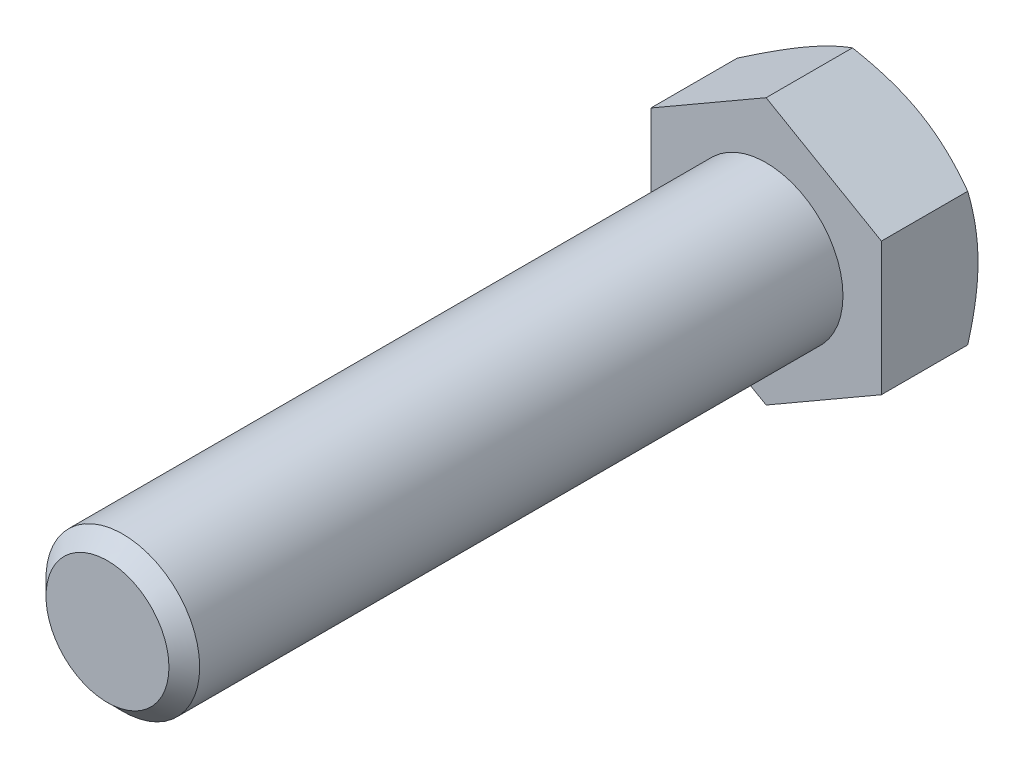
ISO-10303-21;
HEADER;
FILE_DESCRIPTION(('STEP AP214'),'2;1');
FILE_NAME('part.step','',(''),(''),'','','');
FILE_SCHEMA(('AUTOMOTIVE_DESIGN { 1 0 10303 214 1 1 1 1 }'));
ENDSEC;
DATA;
#1=APPLICATION_CONTEXT('core data for automotive mechanical design processes');
#2=APPLICATION_PROTOCOL_DEFINITION('international standard','automotive_design',2000,#1);
#3=PRODUCT_CONTEXT('',#1,'mechanical');
#4=PRODUCT('Part','Part','',(#3));
#5=PRODUCT_RELATED_PRODUCT_CATEGORY('part','',(#4));
#6=PRODUCT_DEFINITION_FORMATION('','',#4);
#7=PRODUCT_DEFINITION_CONTEXT('part definition',#1,'design');
#8=PRODUCT_DEFINITION('design','',#6,#7);
#9=PRODUCT_DEFINITION_SHAPE('','',#8);
#10=(LENGTH_UNIT() NAMED_UNIT(*) SI_UNIT(.MILLI.,.METRE.));
#11=(NAMED_UNIT(*) PLANE_ANGLE_UNIT() SI_UNIT($,.RADIAN.));
#12=(NAMED_UNIT(*) SI_UNIT($,.STERADIAN.) SOLID_ANGLE_UNIT());
#13=UNCERTAINTY_MEASURE_WITH_UNIT(LENGTH_MEASURE(1.E-05),#10,'distance_accuracy_value','');
#14=(GEOMETRIC_REPRESENTATION_CONTEXT(3) GLOBAL_UNCERTAINTY_ASSIGNED_CONTEXT((#13)) GLOBAL_UNIT_ASSIGNED_CONTEXT((#10,
#11,#12)) REPRESENTATION_CONTEXT('',''));
#15=CARTESIAN_POINT('',(0.,0.,0.));
#16=DIRECTION('',(0.,0.,1.));
#17=DIRECTION('',(1.,0.,0.));
#18=AXIS2_PLACEMENT_3D('',#15,#16,#17);
#19=CARTESIAN_POINT('',(0.,0.,60.));
#20=DIRECTION('',(0.,0.,1.));
#21=DIRECTION('',(1.,0.,0.));
#22=AXIS2_PLACEMENT_3D('',#19,#20,#21);
#23=PLANE('',#22);
#24=CARTESIAN_POINT('',(0.,0.,60.));
#25=DIRECTION('',(0.,0.,1.));
#26=DIRECTION('',(1.,0.,0.));
#27=AXIS2_PLACEMENT_3D('',#24,#25,#26);
#28=CIRCLE('',#27,5.60000000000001);
#29=CARTESIAN_POINT('',(5.60000000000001,0.,60.));
#30=VERTEX_POINT('',#29);
#31=EDGE_CURVE('E271',#30,#30,#28,.T.);
#32=ORIENTED_EDGE('',*,*,#31,.T.);
#33=EDGE_LOOP('',(#32));
#34=FACE_BOUND('',#33,.T.);
#35=ADVANCED_FACE('F34',(#34),#23,.T.);
#36=CARTESIAN_POINT('',(0.,0.,0.));
#37=DIRECTION('',(0.,0.,1.));
#38=DIRECTION('',(1.,0.,0.));
#39=AXIS2_PLACEMENT_3D('',#36,#37,#38);
#40=CYLINDRICAL_SURFACE('',#39,7.);
#41=CARTESIAN_POINT('',(0.,0.,58.6));
#42=DIRECTION('',(0.,0.,1.));
#43=DIRECTION('',(1.,0.,0.));
#44=AXIS2_PLACEMENT_3D('',#41,#42,#43);
#45=CIRCLE('',#44,7.);
#46=CARTESIAN_POINT('',(7.00000000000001,0.,58.6));
#47=VERTEX_POINT('',#46);
#48=EDGE_CURVE('E242',#47,#47,#45,.F.);
#49=ORIENTED_EDGE('',*,*,#48,.T.);
#50=EDGE_LOOP('',(#49));
#51=FACE_BOUND('',#50,.T.);
#52=CARTESIAN_POINT('',(0.,0.,0.));
#53=DIRECTION('',(0.,0.,1.));
#54=DIRECTION('',(1.,0.,0.));
#55=AXIS2_PLACEMENT_3D('',#52,#53,#54);
#56=CIRCLE('',#55,7.);
#57=CARTESIAN_POINT('',(7.,0.,0.));
#58=VERTEX_POINT('',#57);
#59=EDGE_CURVE('E268',#58,#58,#56,.F.);
#60=ORIENTED_EDGE('',*,*,#59,.F.);
#61=EDGE_LOOP('',(#60));
#62=FACE_BOUND('',#61,.T.);
#63=ADVANCED_FACE('F206',(#51,#62),#40,.T.);
#64=CARTESIAN_POINT('',(0.,0.,60.));
#65=DIRECTION('',(0.,0.,-1.));
#66=DIRECTION('',(-1.,0.,0.));
#67=AXIS2_PLACEMENT_3D('',#64,#65,#66);
#68=CONICAL_SURFACE('',#67,5.60000000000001,0.785398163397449);
#69=ORIENTED_EDGE('',*,*,#48,.F.);
#70=EDGE_LOOP('',(#69));
#71=FACE_BOUND('',#70,.T.);
#72=ORIENTED_EDGE('',*,*,#31,.F.);
#73=EDGE_LOOP('',(#72));
#74=FACE_BOUND('',#73,.T.);
#75=ADVANCED_FACE('F36',(#71,#74),#68,.T.);
#76=CARTESIAN_POINT('',(0.,12.1243556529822,-8.8));
#77=DIRECTION('',(0.499999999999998,0.86602540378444,0.));
#78=DIRECTION('',(-0.86602540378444,0.499999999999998,0.));
#79=AXIS2_PLACEMENT_3D('',#76,#77,#78);
#80=PLANE('',#79);
#81=CARTESIAN_POINT('',(-0.000200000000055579,12.124471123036,-7.86211115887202));
#82=CARTESIAN_POINT('',(0.230612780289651,11.9912113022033,-7.93903608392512));
#83=CARTESIAN_POINT('',(0.462286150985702,11.8574546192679,-8.0124696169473));
#84=CARTESIAN_POINT('',(0.92749073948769,11.588868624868,-8.15138514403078));
#85=CARTESIAN_POINT('',(1.161022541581,11.4540389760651,-8.21686452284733));
#86=CARTESIAN_POINT('',(1.86538084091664,11.0473775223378,-8.40010423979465));
#87=CARTESIAN_POINT('',(2.33898788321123,10.7739403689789,-8.50433004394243));
#88=CARTESIAN_POINT('',(3.04771913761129,10.3647541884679,-8.62654435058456));
#89=CARTESIAN_POINT('',(3.28072597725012,10.2302276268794,-8.66135857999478));
#90=CARTESIAN_POINT('',(3.7478184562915,9.9605516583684,-8.71973973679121));
#91=CARTESIAN_POINT('',(3.98190411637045,9.82540223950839,-8.74330644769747));
#92=CARTESIAN_POINT('',(4.45046590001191,9.55487796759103,-8.77858873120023));
#93=CARTESIAN_POINT('',(4.68494122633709,9.41950357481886,-8.79031838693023));
#94=CARTESIAN_POINT('',(5.15410845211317,9.14862975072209,-8.80167731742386));
#95=CARTESIAN_POINT('',(5.38880034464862,9.01313032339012,-8.80130696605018));
#96=CARTESIAN_POINT('',(5.82756124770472,8.7598115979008,-8.78930773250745));
#97=CARTESIAN_POINT('',(6.03166122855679,8.64197441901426,-8.77914260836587));
#98=CARTESIAN_POINT('',(6.43938384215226,8.40657565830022,-8.74985839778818));
#99=CARTESIAN_POINT('',(6.64300644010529,8.28901409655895,-8.73073867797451));
#100=CARTESIAN_POINT('',(7.25308524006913,7.93678493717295,-8.6603996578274));
#101=CARTESIAN_POINT('',(7.65846156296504,7.70274080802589,-8.59620926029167));
#102=CARTESIAN_POINT('',(8.47351422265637,7.23216993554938,-8.43573291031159));
#103=CARTESIAN_POINT('',(8.88308654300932,6.99570324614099,-8.33876673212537));
#104=CARTESIAN_POINT('',(9.69612354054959,6.52629611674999,-8.11869386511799));
#105=CARTESIAN_POINT('',(10.0995986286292,6.29334966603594,-7.9956388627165));
#106=CARTESIAN_POINT('',(10.5002,6.06206235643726,-7.86211115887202));
#107=B_SPLINE_CURVE_WITH_KNOTS('',3,(#81,#82,#83,#84,#85,#86,#87,#88,#89,#90,#91,#92,#93,#94,
#95,#96,#97,#98,#99,#100,#101,#102,#103,#104,#105,#106),.UNSPECIFIED.,.F.,.F.,(4,2,2,2,2,2,2,2,
2,2,2,2,4),(0.,0.832130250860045,1.66453336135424,3.33288308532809,4.1465822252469,
4.96029702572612,5.77304256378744,6.58576298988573,7.29326708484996,8.0008212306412,
9.41693497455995,10.8644544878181,12.3091325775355),.UNSPECIFIED.);
#108=CARTESIAN_POINT('',(0.,12.1243556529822,-7.86217782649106));
#109=VERTEX_POINT('',#108);
#110=CARTESIAN_POINT('',(5.24999999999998,9.09326673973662,-8.8));
#111=VERTEX_POINT('',#110);
#112=EDGE_CURVE('E230',#109,#111,#107,.T.);
#113=ORIENTED_EDGE('',*,*,#112,.F.);
#114=DIRECTION('',(0.,0.,1.));
#115=VECTOR('',#114,1.);
#116=CARTESIAN_POINT('',(0.,12.1243556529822,-8.8));
#117=LINE('',#116,#115);
#118=CARTESIAN_POINT('',(0.,12.1243556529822,0.));
#119=VERTEX_POINT('',#118);
#120=EDGE_CURVE('E227',#109,#119,#117,.T.);
#121=ORIENTED_EDGE('',*,*,#120,.T.);
#122=DIRECTION('',(-0.86602540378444,0.499999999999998,0.));
#123=VECTOR('',#122,1.);
#124=CARTESIAN_POINT('',(0.,12.1243556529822,0.));
#125=LINE('',#124,#123);
#126=CARTESIAN_POINT('',(10.5,6.06217782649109,0.));
#127=VERTEX_POINT('',#126);
#128=EDGE_CURVE('E235',#127,#119,#125,.T.);
#129=ORIENTED_EDGE('',*,*,#128,.F.);
#130=DIRECTION('',(0.,0.,1.));
#131=VECTOR('',#130,1.);
#132=CARTESIAN_POINT('',(10.5,6.06217782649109,-8.8));
#133=LINE('',#132,#131);
#134=CARTESIAN_POINT('',(10.5,6.0621778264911,-7.86217782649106));
#135=VERTEX_POINT('',#134);
#136=EDGE_CURVE('E260',#135,#127,#133,.T.);
#137=ORIENTED_EDGE('',*,*,#136,.F.);
#138=EDGE_CURVE('E179',#111,#135,#107,.T.);
#139=ORIENTED_EDGE('',*,*,#138,.F.);
#140=EDGE_LOOP('',(#113,#121,#129,#137,#139));
#141=FACE_BOUND('',#140,.T.);
#142=ADVANCED_FACE('F190',(#141),#80,.T.);
#143=CARTESIAN_POINT('',(10.5,-6.06217782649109,-8.8));
#144=DIRECTION('',(1.,0.,0.));
#145=DIRECTION('',(0.,0.,-1.));
#146=AXIS2_PLACEMENT_3D('',#143,#144,#145);
#147=PLANE('',#146);
#148=CARTESIAN_POINT('',(10.5,-16.5629789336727,-3.53989491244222));
#149=CARTESIAN_POINT('',(10.5,-16.3324493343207,-3.65230404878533));
#150=CARTESIAN_POINT('',(10.5,-16.1016566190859,-3.76417333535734));
#151=CARTESIAN_POINT('',(10.5,-15.6394901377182,-3.98671045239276));
#152=CARTESIAN_POINT('',(10.5,-15.4081163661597,-4.09737827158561));
#153=CARTESIAN_POINT('',(10.5,-14.712983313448,-4.42742432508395));
#154=CARTESIAN_POINT('',(10.5,-14.248276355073,-4.64481383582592));
#155=CARTESIAN_POINT('',(10.5,-13.3134466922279,-5.07413775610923));
#156=CARTESIAN_POINT('',(10.5,-12.8433084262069,-5.2860383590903));
#157=CARTESIAN_POINT('',(10.5,-11.8993888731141,-5.70153466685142));
#158=CARTESIAN_POINT('',(10.5,-11.4256077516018,-5.90513074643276));
#159=CARTESIAN_POINT('',(10.5,-10.4574367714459,-6.30858523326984));
#160=CARTESIAN_POINT('',(10.5,-9.96289464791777,-6.50808008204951));
#161=CARTESIAN_POINT('',(10.5,-8.96812552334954,-6.89263703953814));
#162=CARTESIAN_POINT('',(10.5,-8.46789790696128,-7.07769756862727));
#163=CARTESIAN_POINT('',(10.5,-7.46182642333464,-7.42872878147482));
#164=CARTESIAN_POINT('',(10.5,-6.95599532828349,-7.59473578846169));
#165=CARTESIAN_POINT('',(10.5,-5.93703641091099,-7.90252989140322));
#166=CARTESIAN_POINT('',(10.5,-5.42391085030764,-8.0443243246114));
#167=CARTESIAN_POINT('',(10.5,-4.65004411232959,-8.23348309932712));
#168=CARTESIAN_POINT('',(10.5,-4.39213073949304,-8.29247932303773));
#169=CARTESIAN_POINT('',(10.5,-3.87449212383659,-8.40194855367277));
#170=CARTESIAN_POINT('',(10.5,-3.61476691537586,-8.45242172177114));
#171=CARTESIAN_POINT('',(10.5,-3.09366450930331,-8.54397190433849));
#172=CARTESIAN_POINT('',(10.5,-2.83228735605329,-8.58504917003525));
#173=CARTESIAN_POINT('',(10.5,-2.30813350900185,-8.65699998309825));
#174=CARTESIAN_POINT('',(10.5,-2.04535687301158,-8.68787394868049));
#175=CARTESIAN_POINT('',(10.5,-1.5223239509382,-8.7384014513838));
#176=CARTESIAN_POINT('',(10.5,-1.26208192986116,-8.75820173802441));
#177=CARTESIAN_POINT('',(10.5,-0.740993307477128,-8.78676818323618));
#178=CARTESIAN_POINT('',(10.5,-0.480146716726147,-8.79553453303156));
#179=CARTESIAN_POINT('',(10.5,0.0416860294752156,-8.80182303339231));
#180=CARTESIAN_POINT('',(10.5,0.302672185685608,-8.79934512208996));
#181=CARTESIAN_POINT('',(10.5,0.824301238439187,-8.78320850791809));
#182=CARTESIAN_POINT('',(10.5,1.08494411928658,-8.76954931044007));
#183=CARTESIAN_POINT('',(10.5,1.70298182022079,-8.72419928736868));
#184=CARTESIAN_POINT('',(10.5,2.0600298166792,-8.68766932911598));
#185=CARTESIAN_POINT('',(10.5,2.77164016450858,-8.59555782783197));
#186=CARTESIAN_POINT('',(10.5,3.12620220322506,-8.53997393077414));
#187=CARTESIAN_POINT('',(10.5,4.18565161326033,-8.34757543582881));
#188=CARTESIAN_POINT('',(10.5,4.88595752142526,-8.1851428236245));
#189=CARTESIAN_POINT('',(10.5,5.93370494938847,-7.90132203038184));
#190=CARTESIAN_POINT('',(10.5,6.28651822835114,-7.79860514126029));
#191=CARTESIAN_POINT('',(10.5,6.98872323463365,-7.58197095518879));
#192=CARTESIAN_POINT('',(10.5,7.33811493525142,-7.4680535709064));
#193=CARTESIAN_POINT('',(10.5,8.03358066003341,-7.23088999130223));
#194=CARTESIAN_POINT('',(10.5,8.37965557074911,-7.10764637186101));
#195=CARTESIAN_POINT('',(10.5,9.06889903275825,-6.85333339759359));
#196=CARTESIAN_POINT('',(10.5,9.41206765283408,-6.72226422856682));
#197=CARTESIAN_POINT('',(10.5,10.3427918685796,-6.35655861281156));
#198=CARTESIAN_POINT('',(10.5,10.9278216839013,-6.1154998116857));
#199=CARTESIAN_POINT('',(10.5,12.0917802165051,-5.61902471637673));
#200=CARTESIAN_POINT('',(10.5,12.6707082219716,-5.36360676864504));
#201=CARTESIAN_POINT('',(10.5,13.8238790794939,-4.8418421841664));
#202=CARTESIAN_POINT('',(10.5,14.398119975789,-4.5754912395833));
#203=CARTESIAN_POINT('',(10.5,15.542640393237,-4.03450017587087));
#204=CARTESIAN_POINT('',(10.5,16.1129200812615,-3.75986040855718));
#205=CARTESIAN_POINT('',(10.5,17.2512491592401,-3.20365321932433));
#206=CARTESIAN_POINT('',(10.5,17.8192933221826,-2.92207512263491));
#207=CARTESIAN_POINT('',(10.5,18.9528074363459,-2.35378095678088));
#208=CARTESIAN_POINT('',(10.5,19.5182773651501,-2.06706484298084));
#209=CARTESIAN_POINT('',(10.5,20.6469787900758,-1.48957659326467));
#210=CARTESIAN_POINT('',(10.5,21.210210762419,-1.19880538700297));
#211=CARTESIAN_POINT('',(10.5,22.3349267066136,-0.613909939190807));
#212=CARTESIAN_POINT('',(10.5,22.8964106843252,-0.319785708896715));
#213=CARTESIAN_POINT('',(10.5,24.4583663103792,0.503299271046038));
#214=CARTESIAN_POINT('',(10.5,25.4572548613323,1.03526359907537));
#215=CARTESIAN_POINT('',(10.5,27.4516969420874,2.10554559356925));
#216=CARTESIAN_POINT('',(10.5,28.4472502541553,2.64386366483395));
#217=CARTESIAN_POINT('',(10.5,30.4323747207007,3.7233782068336));
#218=CARTESIAN_POINT('',(10.5,31.4219546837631,4.26455848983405));
#219=CARTESIAN_POINT('',(10.5,32.9047991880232,5.07900862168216));
#220=CARTESIAN_POINT('',(10.5,33.3988066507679,5.35092764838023));
#221=CARTESIAN_POINT('',(10.5,34.3863794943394,5.89556593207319));
#222=CARTESIAN_POINT('',(10.5,34.8799448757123,6.16828518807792));
#223=CARTESIAN_POINT('',(10.5,35.3733163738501,6.44135483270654));
#224=B_SPLINE_CURVE_WITH_KNOTS('',3,(#148,#149,#150,#151,#152,#153,#154,#155,#156,#157,#158,
#159,#160,#161,#162,#163,#164,#165,#166,#167,#168,#169,#170,#171,#172,#173,#174,#175,#176,#177,
#178,#179,#180,#181,#182,#183,#184,#185,#186,#187,#188,#189,#190,#191,#192,#193,#194,#195,#196,
#197,#198,#199,#200,#201,#202,#203,#204,#205,#206,#207,#208,#209,#210,#211,#212,#213,#214,#215,
#216,#217,#218,#219,#220,#221,#222,#223),.UNSPECIFIED.,.F.,.F.,(4,2,2,2,2,2,2,2,2,2,2,2,2,2,2,2,
2,2,2,2,2,2,2,2,2,2,2,2,2,2,2,2,2,2,2,2,2,4),(0.,0.769425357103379,1.53885792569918,
3.07793697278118,4.62493168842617,6.17185650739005,7.77147528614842,9.37126887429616,
10.9679601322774,12.5641666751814,13.357773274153,14.1513648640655,14.9449352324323,
15.7384730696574,16.5212293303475,17.303972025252,18.0867190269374,18.8695006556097,
19.9456341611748,21.0219006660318,23.1754668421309,24.2777514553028,25.3800446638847,
26.4820345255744,27.5839982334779,29.4819519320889,31.3801246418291,33.279052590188,
35.1779000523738,37.0798780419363,38.9818725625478,40.8834379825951,42.7849970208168,
46.1800870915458,49.5753946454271,52.9590658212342,54.650765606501,56.3424632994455),.UNSPECIFIED.);
#225=CARTESIAN_POINT('',(10.5,0.,-8.8));
#226=VERTEX_POINT('',#225);
#227=EDGE_CURVE('E177',#135,#226,#224,.F.);
#228=ORIENTED_EDGE('',*,*,#227,.F.);
#229=ORIENTED_EDGE('',*,*,#136,.T.);
#230=DIRECTION('',(0.,1.,0.));
#231=VECTOR('',#230,1.);
#232=CARTESIAN_POINT('',(10.5,-6.06217782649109,0.));
#233=LINE('',#232,#231);
#234=CARTESIAN_POINT('',(10.5,-6.06217782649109,0.));
#235=VERTEX_POINT('',#234);
#236=EDGE_CURVE('E267',#235,#127,#233,.T.);
#237=ORIENTED_EDGE('',*,*,#236,.F.);
#238=DIRECTION('',(0.,0.,1.));
#239=VECTOR('',#238,1.);
#240=CARTESIAN_POINT('',(10.5,-6.06217782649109,-8.8));
#241=LINE('',#240,#239);
#242=CARTESIAN_POINT('',(10.5,-6.06217782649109,-7.86217782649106));
#243=VERTEX_POINT('',#242);
#244=EDGE_CURVE('E245',#243,#235,#241,.T.);
#245=ORIENTED_EDGE('',*,*,#244,.F.);
#246=EDGE_CURVE('E171',#226,#243,#224,.F.);
#247=ORIENTED_EDGE('',*,*,#246,.F.);
#248=EDGE_LOOP('',(#228,#229,#237,#245,#247));
#249=FACE_BOUND('',#248,.T.);
#250=ADVANCED_FACE('F186',(#249),#147,.T.);
#251=CARTESIAN_POINT('',(0.,-12.1243556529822,-8.8));
#252=DIRECTION('',(0.499999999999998,-0.86602540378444,0.));
#253=DIRECTION('',(0.86602540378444,0.499999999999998,0.));
#254=AXIS2_PLACEMENT_3D('',#251,#252,#253);
#255=PLANE('',#254);
#256=CARTESIAN_POINT('',(10.5002,-6.06206235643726,-7.86211115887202));
#257=CARTESIAN_POINT('',(10.2693872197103,-6.19532217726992,-7.93903608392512));
#258=CARTESIAN_POINT('',(10.0377138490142,-6.32907886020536,-8.01246961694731));
#259=CARTESIAN_POINT('',(9.57250926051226,-6.59766485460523,-8.15138514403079));
#260=CARTESIAN_POINT('',(9.33897745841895,-6.73249450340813,-8.21686452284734));
#261=CARTESIAN_POINT('',(8.63461915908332,-7.13915595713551,-8.40010423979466));
#262=CARTESIAN_POINT('',(8.16101211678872,-7.4125931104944,-8.50433004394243));
#263=CARTESIAN_POINT('',(7.45228086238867,-7.82177929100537,-8.62654435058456));
#264=CARTESIAN_POINT('',(7.21927402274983,-7.95630585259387,-8.66135857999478));
#265=CARTESIAN_POINT('',(6.75218154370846,-8.22598182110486,-8.71973973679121));
#266=CARTESIAN_POINT('',(6.5180958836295,-8.36113123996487,-8.74330644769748));
#267=CARTESIAN_POINT('',(6.04953409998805,-8.63165551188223,-8.77858873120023));
#268=CARTESIAN_POINT('',(5.81505877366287,-8.7670299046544,-8.79031838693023));
#269=CARTESIAN_POINT('',(5.34589154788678,-9.03790372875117,-8.80167731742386));
#270=CARTESIAN_POINT('',(5.11119965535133,-9.17340315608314,-8.80130696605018));
#271=CARTESIAN_POINT('',(4.67243875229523,-9.42672188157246,-8.78930773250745));
#272=CARTESIAN_POINT('',(4.46833877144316,-9.544559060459,-8.77914260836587));
#273=CARTESIAN_POINT('',(4.06061615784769,-9.77995782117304,-8.74985839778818));
#274=CARTESIAN_POINT('',(3.85699355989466,-9.89751938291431,-8.73073867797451));
#275=CARTESIAN_POINT('',(3.24691475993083,-10.2497485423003,-8.6603996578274));
#276=CARTESIAN_POINT('',(2.84153843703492,-10.4837926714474,-8.59620926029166));
#277=CARTESIAN_POINT('',(2.02648577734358,-10.9543635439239,-8.43573291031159));
#278=CARTESIAN_POINT('',(1.61691345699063,-11.1908302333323,-8.33876673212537));
#279=CARTESIAN_POINT('',(0.803876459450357,-11.6602373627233,-8.11869386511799));
#280=CARTESIAN_POINT('',(0.400401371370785,-11.8931838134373,-7.99563886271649));
#281=CARTESIAN_POINT('',(-0.000200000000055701,-12.124471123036,-7.86211115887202));
#282=B_SPLINE_CURVE_WITH_KNOTS('',3,(#256,#257,#258,#259,#260,#261,#262,#263,#264,#265,#266,
#267,#268,#269,#270,#271,#272,#273,#274,#275,#276,#277,#278,#279,#280,#281),.UNSPECIFIED.,.F.,
.F.,(4,2,2,2,2,2,2,2,2,2,2,2,4),(0.,0.832130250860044,1.66453336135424,3.33288308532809,
4.1465822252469,4.96029702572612,5.77304256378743,6.58576298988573,7.29326708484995,
8.0008212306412,9.41693497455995,10.8644544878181,12.3091325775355),.UNSPECIFIED.);
#283=CARTESIAN_POINT('',(5.24999999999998,-9.09326673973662,-8.8));
#284=VERTEX_POINT('',#283);
#285=EDGE_CURVE('E178',#243,#284,#282,.T.);
#286=ORIENTED_EDGE('',*,*,#285,.F.);
#287=ORIENTED_EDGE('',*,*,#244,.T.);
#288=DIRECTION('',(0.86602540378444,0.499999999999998,0.));
#289=VECTOR('',#288,1.);
#290=CARTESIAN_POINT('',(0.,-12.1243556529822,0.));
#291=LINE('',#290,#289);
#292=CARTESIAN_POINT('',(0.,-12.1243556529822,0.));
#293=VERTEX_POINT('',#292);
#294=EDGE_CURVE('E256',#293,#235,#291,.T.);
#295=ORIENTED_EDGE('',*,*,#294,.F.);
#296=DIRECTION('',(0.,0.,1.));
#297=VECTOR('',#296,1.);
#298=CARTESIAN_POINT('',(0.,-12.1243556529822,-8.8));
#299=LINE('',#298,#297);
#300=CARTESIAN_POINT('',(0.,-12.1243556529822,-7.86217782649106));
#301=VERTEX_POINT('',#300);
#302=EDGE_CURVE('E255',#301,#293,#299,.T.);
#303=ORIENTED_EDGE('',*,*,#302,.F.);
#304=EDGE_CURVE('E164',#284,#301,#282,.T.);
#305=ORIENTED_EDGE('',*,*,#304,.F.);
#306=EDGE_LOOP('',(#286,#287,#295,#303,#305));
#307=FACE_BOUND('',#306,.T.);
#308=ADVANCED_FACE('F189',(#307),#255,.T.);
#309=CARTESIAN_POINT('',(0.,-12.1243556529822,-8.8));
#310=DIRECTION('',(-0.500000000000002,-0.866025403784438,0.));
#311=DIRECTION('',(0.866025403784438,-0.500000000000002,0.));
#312=AXIS2_PLACEMENT_3D('',#309,#310,#311);
#313=PLANE('',#312);
#314=CARTESIAN_POINT('',(0.000199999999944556,-12.124471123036,-7.86211115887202));
#315=CARTESIAN_POINT('',(-0.230612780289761,-11.9912113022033,-7.93903608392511));
#316=CARTESIAN_POINT('',(-0.462286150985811,-11.8574546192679,-8.0124696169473));
#317=CARTESIAN_POINT('',(-0.927490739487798,-11.588868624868,-8.15138514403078));
#318=CARTESIAN_POINT('',(-1.16102254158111,-11.4540389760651,-8.21686452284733));
#319=CARTESIAN_POINT('',(-1.86538084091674,-11.0473775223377,-8.40010423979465));
#320=CARTESIAN_POINT('',(-2.33898788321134,-10.7739403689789,-8.50433004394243));
#321=CARTESIAN_POINT('',(-3.04771913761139,-10.3647541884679,-8.62654435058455));
#322=CARTESIAN_POINT('',(-3.28072597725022,-10.2302276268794,-8.66135857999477));
#323=CARTESIAN_POINT('',(-3.7478184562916,-9.96055165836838,-8.7197397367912));
#324=CARTESIAN_POINT('',(-3.98190411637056,-9.82540223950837,-8.74330644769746));
#325=CARTESIAN_POINT('',(-4.45046590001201,-9.554877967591,-8.77858873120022));
#326=CARTESIAN_POINT('',(-4.68494122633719,-9.41950357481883,-8.79031838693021));
#327=CARTESIAN_POINT('',(-5.15410845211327,-9.14862975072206,-8.80167731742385));
#328=CARTESIAN_POINT('',(-5.38880034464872,-9.0131303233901,-8.80130696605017));
#329=CARTESIAN_POINT('',(-5.82756124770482,-8.75981159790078,-8.78930773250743));
#330=CARTESIAN_POINT('',(-6.03166122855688,-8.64197441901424,-8.77914260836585));
#331=CARTESIAN_POINT('',(-6.43938384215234,-8.4065756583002,-8.74985839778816));
#332=CARTESIAN_POINT('',(-6.64300644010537,-8.28901409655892,-8.73073867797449));
#333=CARTESIAN_POINT('',(-7.25308524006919,-7.93678493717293,-8.66039965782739));
#334=CARTESIAN_POINT('',(-7.65846156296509,-7.70274080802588,-8.59620926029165));
#335=CARTESIAN_POINT('',(-8.47351422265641,-7.23216993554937,-8.43573291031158));
#336=CARTESIAN_POINT('',(-8.88308654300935,-6.99570324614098,-8.33876673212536));
#337=CARTESIAN_POINT('',(-9.69612354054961,-6.52629611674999,-8.11869386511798));
#338=CARTESIAN_POINT('',(-10.0995986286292,-6.29334966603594,-7.99563886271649));
#339=CARTESIAN_POINT('',(-10.5002,-6.06206235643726,-7.86211115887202));
#340=B_SPLINE_CURVE_WITH_KNOTS('',3,(#314,#315,#316,#317,#318,#319,#320,#321,#322,#323,#324,
#325,#326,#327,#328,#329,#330,#331,#332,#333,#334,#335,#336,#337,#338,#339),.UNSPECIFIED.,.F.,
.F.,(4,2,2,2,2,2,2,2,2,2,2,2,4),(0.,0.832130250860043,1.66453336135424,3.33288308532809,
4.1465822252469,4.96029702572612,5.77304256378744,6.58576298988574,7.29326708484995,
8.00082123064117,9.4169349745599,10.864454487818,12.3091325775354),.UNSPECIFIED.);
#341=CARTESIAN_POINT('',(-5.25000000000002,-9.0932667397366,-8.8));
#342=VERTEX_POINT('',#341);
#343=EDGE_CURVE('E251',#301,#342,#340,.T.);
#344=ORIENTED_EDGE('',*,*,#343,.F.);
#345=ORIENTED_EDGE('',*,*,#302,.T.);
#346=DIRECTION('',(0.866025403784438,-0.500000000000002,0.));
#347=VECTOR('',#346,1.);
#348=CARTESIAN_POINT('',(0.,-12.1243556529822,0.));
#349=LINE('',#348,#347);
#350=CARTESIAN_POINT('',(-10.5,-6.06217782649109,0.));
#351=VERTEX_POINT('',#350);
#352=EDGE_CURVE('E389',#351,#293,#349,.T.);
#353=ORIENTED_EDGE('',*,*,#352,.F.);
#354=DIRECTION('',(0.,0.,1.));
#355=VECTOR('',#354,1.);
#356=CARTESIAN_POINT('',(-10.5,-6.06217782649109,-8.8));
#357=LINE('',#356,#355);
#358=CARTESIAN_POINT('',(-10.5,-6.06217782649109,-7.86217782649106));
#359=VERTEX_POINT('',#358);
#360=EDGE_CURVE('E258',#359,#351,#357,.T.);
#361=ORIENTED_EDGE('',*,*,#360,.F.);
#362=EDGE_CURVE('E111',#342,#359,#340,.T.);
#363=ORIENTED_EDGE('',*,*,#362,.F.);
#364=EDGE_LOOP('',(#344,#345,#353,#361,#363));
#365=FACE_BOUND('',#364,.T.);
#366=ADVANCED_FACE('F195',(#365),#313,.T.);
#367=CARTESIAN_POINT('',(-10.5,-6.06217782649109,-8.8));
#368=DIRECTION('',(-1.,0.,0.));
#369=DIRECTION('',(0.,0.,1.));
#370=AXIS2_PLACEMENT_3D('',#367,#368,#369);
#371=PLANE('',#370);
#372=CARTESIAN_POINT('',(-10.5,-16.5629789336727,-3.53989491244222));
#373=CARTESIAN_POINT('',(-10.5,-16.3324493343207,-3.65230404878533));
#374=CARTESIAN_POINT('',(-10.5,-16.1016566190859,-3.76417333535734));
#375=CARTESIAN_POINT('',(-10.5,-15.6394901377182,-3.98671045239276));
#376=CARTESIAN_POINT('',(-10.5,-15.4081163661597,-4.09737827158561));
#377=CARTESIAN_POINT('',(-10.5,-14.712983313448,-4.42742432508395));
#378=CARTESIAN_POINT('',(-10.5,-14.248276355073,-4.64481383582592));
#379=CARTESIAN_POINT('',(-10.5,-13.3134466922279,-5.07413775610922));
#380=CARTESIAN_POINT('',(-10.5,-12.8433084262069,-5.2860383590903));
#381=CARTESIAN_POINT('',(-10.5,-11.8993888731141,-5.70153466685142));
#382=CARTESIAN_POINT('',(-10.5,-11.4256077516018,-5.90513074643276));
#383=CARTESIAN_POINT('',(-10.5,-10.4574367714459,-6.30858523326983));
#384=CARTESIAN_POINT('',(-10.5,-9.96289464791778,-6.5080800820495));
#385=CARTESIAN_POINT('',(-10.5,-8.96812552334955,-6.89263703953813));
#386=CARTESIAN_POINT('',(-10.5,-8.46789790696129,-7.07769756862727));
#387=CARTESIAN_POINT('',(-10.5,-7.46182642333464,-7.42872878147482));
#388=CARTESIAN_POINT('',(-10.5,-6.9559953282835,-7.59473578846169));
#389=CARTESIAN_POINT('',(-10.5,-5.93703641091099,-7.90252989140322));
#390=CARTESIAN_POINT('',(-10.5,-5.42391085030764,-8.0443243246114));
#391=CARTESIAN_POINT('',(-10.5,-4.65004411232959,-8.23348309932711));
#392=CARTESIAN_POINT('',(-10.5,-4.39213073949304,-8.29247932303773));
#393=CARTESIAN_POINT('',(-10.5,-3.87449212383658,-8.40194855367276));
#394=CARTESIAN_POINT('',(-10.5,-3.61476691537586,-8.45242172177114));
#395=CARTESIAN_POINT('',(-10.5,-3.09366450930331,-8.54397190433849));
#396=CARTESIAN_POINT('',(-10.5,-2.83228735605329,-8.58504917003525));
#397=CARTESIAN_POINT('',(-10.5,-2.30813350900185,-8.65699998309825));
#398=CARTESIAN_POINT('',(-10.5,-2.04535687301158,-8.68787394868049));
#399=CARTESIAN_POINT('',(-10.5,-1.5223239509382,-8.7384014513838));
#400=CARTESIAN_POINT('',(-10.5,-1.26208192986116,-8.75820173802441));
#401=CARTESIAN_POINT('',(-10.5,-0.740993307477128,-8.78676818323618));
#402=CARTESIAN_POINT('',(-10.5,-0.480146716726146,-8.79553453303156));
#403=CARTESIAN_POINT('',(-10.5,0.0416860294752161,-8.80182303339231));
#404=CARTESIAN_POINT('',(-10.5,0.302672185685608,-8.79934512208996));
#405=CARTESIAN_POINT('',(-10.5,0.824301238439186,-8.78320850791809));
#406=CARTESIAN_POINT('',(-10.5,1.08494411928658,-8.76954931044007));
#407=CARTESIAN_POINT('',(-10.5,1.70298182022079,-8.72419928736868));
#408=CARTESIAN_POINT('',(-10.5,2.0600298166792,-8.68766932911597));
#409=CARTESIAN_POINT('',(-10.5,2.77164016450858,-8.59555782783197));
#410=CARTESIAN_POINT('',(-10.5,3.12620220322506,-8.53997393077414));
#411=CARTESIAN_POINT('',(-10.5,4.18565161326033,-8.34757543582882));
#412=CARTESIAN_POINT('',(-10.5,4.88595752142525,-8.1851428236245));
#413=CARTESIAN_POINT('',(-10.5,5.93370494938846,-7.90132203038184));
#414=CARTESIAN_POINT('',(-10.5,6.28651822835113,-7.79860514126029));
#415=CARTESIAN_POINT('',(-10.5,6.98872323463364,-7.5819709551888));
#416=CARTESIAN_POINT('',(-10.5,7.33811493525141,-7.4680535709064));
#417=CARTESIAN_POINT('',(-10.5,8.0335806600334,-7.23088999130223));
#418=CARTESIAN_POINT('',(-10.5,8.3796555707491,-7.10764637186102));
#419=CARTESIAN_POINT('',(-10.5,9.06889903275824,-6.85333339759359));
#420=CARTESIAN_POINT('',(-10.5,9.41206765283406,-6.72226422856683));
#421=CARTESIAN_POINT('',(-10.5,10.3427918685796,-6.35655861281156));
#422=CARTESIAN_POINT('',(-10.5,10.9278216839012,-6.1154998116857));
#423=CARTESIAN_POINT('',(-10.5,12.0917802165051,-5.61902471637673));
#424=CARTESIAN_POINT('',(-10.5,12.6707082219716,-5.36360676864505));
#425=CARTESIAN_POINT('',(-10.5,13.8238790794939,-4.84184218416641));
#426=CARTESIAN_POINT('',(-10.5,14.398119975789,-4.57549123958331));
#427=CARTESIAN_POINT('',(-10.5,15.542640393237,-4.03450017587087));
#428=CARTESIAN_POINT('',(-10.5,16.1129200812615,-3.75986040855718));
#429=CARTESIAN_POINT('',(-10.5,17.25124915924,-3.20365321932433));
#430=CARTESIAN_POINT('',(-10.5,17.8192933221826,-2.92207512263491));
#431=CARTESIAN_POINT('',(-10.5,18.9528074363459,-2.35378095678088));
#432=CARTESIAN_POINT('',(-10.5,19.5182773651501,-2.06706484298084));
#433=CARTESIAN_POINT('',(-10.5,20.6469787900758,-1.48957659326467));
#434=CARTESIAN_POINT('',(-10.5,21.210210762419,-1.19880538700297));
#435=CARTESIAN_POINT('',(-10.5,22.3349267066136,-0.613909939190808));
#436=CARTESIAN_POINT('',(-10.5,22.8964106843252,-0.319785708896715));
#437=CARTESIAN_POINT('',(-10.5,24.4583663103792,0.503299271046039));
#438=CARTESIAN_POINT('',(-10.5,25.4572548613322,1.03526359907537));
#439=CARTESIAN_POINT('',(-10.5,27.4516969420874,2.10554559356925));
#440=CARTESIAN_POINT('',(-10.5,28.4472502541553,2.64386366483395));
#441=CARTESIAN_POINT('',(-10.5,30.4323747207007,3.7233782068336));
#442=CARTESIAN_POINT('',(-10.5,31.4219546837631,4.26455848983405));
#443=CARTESIAN_POINT('',(-10.5,32.9047991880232,5.07900862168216));
#444=CARTESIAN_POINT('',(-10.5,33.3988066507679,5.35092764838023));
#445=CARTESIAN_POINT('',(-10.5,34.3863794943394,5.89556593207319));
#446=CARTESIAN_POINT('',(-10.5,34.8799448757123,6.16828518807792));
#447=CARTESIAN_POINT('',(-10.5,35.3733163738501,6.44135483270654));
#448=B_SPLINE_CURVE_WITH_KNOTS('',3,(#372,#373,#374,#375,#376,#377,#378,#379,#380,#381,#382,
#383,#384,#385,#386,#387,#388,#389,#390,#391,#392,#393,#394,#395,#396,#397,#398,#399,#400,#401,
#402,#403,#404,#405,#406,#407,#408,#409,#410,#411,#412,#413,#414,#415,#416,#417,#418,#419,#420,
#421,#422,#423,#424,#425,#426,#427,#428,#429,#430,#431,#432,#433,#434,#435,#436,#437,#438,#439,
#440,#441,#442,#443,#444,#445,#446,#447),.UNSPECIFIED.,.F.,.F.,(4,2,2,2,2,2,2,2,2,2,2,2,2,2,2,2,
2,2,2,2,2,2,2,2,2,2,2,2,2,2,2,2,2,2,2,2,2,4),(0.,0.769425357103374,1.53885792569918,
3.07793697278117,4.62493168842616,6.17185650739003,7.77147528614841,9.37126887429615,
10.9679601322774,12.5641666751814,13.357773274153,14.1513648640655,14.9449352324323,
15.7384730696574,16.5212293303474,17.303972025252,18.0867190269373,18.8695006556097,
19.9456341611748,21.0219006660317,23.1754668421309,24.2777514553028,25.3800446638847,
26.4820345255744,27.5839982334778,29.4819519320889,31.380124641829,33.279052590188,
35.1779000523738,37.0798780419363,38.9818725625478,40.8834379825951,42.7849970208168,
46.1800870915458,49.5753946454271,52.9590658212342,54.650765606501,56.3424632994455),.UNSPECIFIED.);
#449=CARTESIAN_POINT('',(-10.5,0.,-8.8));
#450=VERTEX_POINT('',#449);
#451=EDGE_CURVE('E106',#359,#450,#448,.T.);
#452=ORIENTED_EDGE('',*,*,#451,.F.);
#453=ORIENTED_EDGE('',*,*,#360,.T.);
#454=DIRECTION('',(0.,-1.,0.));
#455=VECTOR('',#454,1.);
#456=CARTESIAN_POINT('',(-10.5,-6.06217782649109,0.));
#457=LINE('',#456,#455);
#458=CARTESIAN_POINT('',(-10.5,6.06217782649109,0.));
#459=VERTEX_POINT('',#458);
#460=EDGE_CURVE('E391',#459,#351,#457,.T.);
#461=ORIENTED_EDGE('',*,*,#460,.F.);
#462=DIRECTION('',(0.,0.,1.));
#463=VECTOR('',#462,1.);
#464=CARTESIAN_POINT('',(-10.5,6.06217782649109,-8.8));
#465=LINE('',#464,#463);
#466=CARTESIAN_POINT('',(-10.5,6.06217782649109,-7.86217782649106));
#467=VERTEX_POINT('',#466);
#468=EDGE_CURVE('E132',#467,#459,#465,.T.);
#469=ORIENTED_EDGE('',*,*,#468,.F.);
#470=EDGE_CURVE('E115',#450,#467,#448,.T.);
#471=ORIENTED_EDGE('',*,*,#470,.F.);
#472=EDGE_LOOP('',(#452,#453,#461,#469,#471));
#473=FACE_BOUND('',#472,.T.);
#474=ADVANCED_FACE('F130',(#473),#371,.T.);
#475=CARTESIAN_POINT('',(-10.5,6.06217782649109,-8.8));
#476=DIRECTION('',(-0.500000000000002,0.866025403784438,0.));
#477=DIRECTION('',(-0.866025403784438,-0.500000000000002,0.));
#478=AXIS2_PLACEMENT_3D('',#475,#476,#477);
#479=PLANE('',#478);
#480=CARTESIAN_POINT('',(-10.5002,6.06206235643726,-7.86211115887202));
#481=CARTESIAN_POINT('',(-10.2693872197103,6.19532217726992,-7.93903608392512));
#482=CARTESIAN_POINT('',(-10.0377138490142,6.32907886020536,-8.01246961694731));
#483=CARTESIAN_POINT('',(-9.57250926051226,6.59766485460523,-8.15138514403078));
#484=CARTESIAN_POINT('',(-9.33897745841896,6.73249450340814,-8.21686452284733));
#485=CARTESIAN_POINT('',(-8.63461915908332,7.13915595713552,-8.40010423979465));
#486=CARTESIAN_POINT('',(-8.16101211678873,7.41259311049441,-8.50433004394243));
#487=CARTESIAN_POINT('',(-7.45228086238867,7.82177929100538,-8.62654435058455));
#488=CARTESIAN_POINT('',(-7.21927402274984,7.95630585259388,-8.66135857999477));
#489=CARTESIAN_POINT('',(-6.75218154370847,8.22598182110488,-8.7197397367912));
#490=CARTESIAN_POINT('',(-6.51809588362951,8.36113123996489,-8.74330644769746));
#491=CARTESIAN_POINT('',(-6.04953409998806,8.63165551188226,-8.77858873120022));
#492=CARTESIAN_POINT('',(-5.81505877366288,8.76702990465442,-8.79031838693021));
#493=CARTESIAN_POINT('',(-5.34589154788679,9.0379037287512,-8.80167731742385));
#494=CARTESIAN_POINT('',(-5.11119965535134,9.17340315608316,-8.80130696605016));
#495=CARTESIAN_POINT('',(-4.67243875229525,9.42672188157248,-8.78930773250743));
#496=CARTESIAN_POINT('',(-4.46833877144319,9.54455906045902,-8.77914260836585));
#497=CARTESIAN_POINT('',(-4.06061615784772,9.77995782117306,-8.74985839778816));
#498=CARTESIAN_POINT('',(-3.85699355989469,9.89751938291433,-8.73073867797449));
#499=CARTESIAN_POINT('',(-3.24691475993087,10.2497485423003,-8.66039965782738));
#500=CARTESIAN_POINT('',(-2.84153843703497,10.4837926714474,-8.59620926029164));
#501=CARTESIAN_POINT('',(-2.02648577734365,10.9543635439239,-8.43573291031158));
#502=CARTESIAN_POINT('',(-1.61691345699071,11.1908302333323,-8.33876673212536));
#503=CARTESIAN_POINT('',(-0.803876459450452,11.6602373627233,-8.11869386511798));
#504=CARTESIAN_POINT('',(-0.400401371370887,11.8931838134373,-7.99563886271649));
#505=CARTESIAN_POINT('',(0.00019999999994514,12.124471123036,-7.86211115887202));
#506=B_SPLINE_CURVE_WITH_KNOTS('',3,(#480,#481,#482,#483,#484,#485,#486,#487,#488,#489,#490,
#491,#492,#493,#494,#495,#496,#497,#498,#499,#500,#501,#502,#503,#504,#505),.UNSPECIFIED.,.F.,
.F.,(4,2,2,2,2,2,2,2,2,2,2,2,4),(0.,0.832130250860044,1.66453336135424,3.33288308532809,
4.1465822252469,4.96029702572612,5.77304256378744,6.58576298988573,7.29326708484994,
8.00082123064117,9.4169349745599,10.864454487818,12.3091325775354),.UNSPECIFIED.);
#507=CARTESIAN_POINT('',(-5.25000000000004,9.09326673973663,-8.8));
#508=VERTEX_POINT('',#507);
#509=EDGE_CURVE('E121',#467,#508,#506,.T.);
#510=ORIENTED_EDGE('',*,*,#509,.F.);
#511=ORIENTED_EDGE('',*,*,#468,.T.);
#512=DIRECTION('',(-0.866025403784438,-0.500000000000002,0.));
#513=VECTOR('',#512,1.);
#514=CARTESIAN_POINT('',(-10.5,6.06217782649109,0.));
#515=LINE('',#514,#513);
#516=EDGE_CURVE('E237',#119,#459,#515,.T.);
#517=ORIENTED_EDGE('',*,*,#516,.F.);
#518=ORIENTED_EDGE('',*,*,#120,.F.);
#519=EDGE_CURVE('E123',#508,#109,#506,.T.);
#520=ORIENTED_EDGE('',*,*,#519,.F.);
#521=EDGE_LOOP('',(#510,#511,#517,#518,#520));
#522=FACE_BOUND('',#521,.T.);
#523=ADVANCED_FACE('F203',(#522),#479,.T.);
#524=CARTESIAN_POINT('',(10.5,6.06217782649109,0.));
#525=DIRECTION('',(0.,0.,1.));
#526=DIRECTION('',(1.,0.,0.));
#527=AXIS2_PLACEMENT_3D('',#524,#525,#526);
#528=PLANE('',#527);
#529=ORIENTED_EDGE('',*,*,#59,.T.);
#530=EDGE_LOOP('',(#529));
#531=FACE_BOUND('',#530,.T.);
#532=ORIENTED_EDGE('',*,*,#128,.T.);
#533=ORIENTED_EDGE('',*,*,#516,.T.);
#534=ORIENTED_EDGE('',*,*,#460,.T.);
#535=ORIENTED_EDGE('',*,*,#352,.T.);
#536=ORIENTED_EDGE('',*,*,#294,.T.);
#537=ORIENTED_EDGE('',*,*,#236,.T.);
#538=EDGE_LOOP('',(#532,#533,#534,#535,#536,#537));
#539=FACE_BOUND('',#538,.T.);
#540=ADVANCED_FACE('F192',(#531,#539),#528,.T.);
#541=CARTESIAN_POINT('',(0.,0.,0.));
#542=DIRECTION('',(0.,0.,1.));
#543=DIRECTION('',(1.,0.,0.));
#544=AXIS2_PLACEMENT_3D('',#541,#542,#543);
#545=CONICAL_SURFACE('',#544,25.7420471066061,1.0471975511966);
#546=ORIENTED_EDGE('',*,*,#138,.T.);
#547=ORIENTED_EDGE('',*,*,#227,.T.);
#548=CARTESIAN_POINT('',(0.,0.,-8.8));
#549=DIRECTION('',(0.,0.,1.));
#550=DIRECTION('',(1.,0.,0.));
#551=AXIS2_PLACEMENT_3D('',#548,#549,#550);
#552=CIRCLE('',#551,10.5);
#553=EDGE_CURVE('E38',#111,#226,#552,.F.);
#554=ORIENTED_EDGE('',*,*,#553,.F.);
#555=EDGE_LOOP('',(#546,#547,#554));
#556=FACE_BOUND('',#555,.T.);
#557=ADVANCED_FACE('F223',(#556),#545,.T.);
#558=ORIENTED_EDGE('',*,*,#112,.T.);
#559=EDGE_CURVE('E128',#508,#111,#552,.F.);
#560=ORIENTED_EDGE('',*,*,#559,.F.);
#561=ORIENTED_EDGE('',*,*,#519,.T.);
#562=EDGE_LOOP('',(#558,#560,#561));
#563=FACE_BOUND('',#562,.T.);
#564=ADVANCED_FACE('F156',(#563),#545,.T.);
#565=ORIENTED_EDGE('',*,*,#470,.T.);
#566=ORIENTED_EDGE('',*,*,#509,.T.);
#567=CARTESIAN_POINT('',(0.,0.,-8.8));
#568=DIRECTION('',(0.,0.,-1.));
#569=DIRECTION('',(-1.,0.,0.));
#570=AXIS2_PLACEMENT_3D('',#567,#568,#569);
#571=CIRCLE('',#570,10.5);
#572=EDGE_CURVE('E56',#450,#508,#571,.T.);
#573=ORIENTED_EDGE('',*,*,#572,.F.);
#574=EDGE_LOOP('',(#565,#566,#573));
#575=FACE_BOUND('',#574,.T.);
#576=ADVANCED_FACE('F119',(#575),#545,.T.);
#577=ORIENTED_EDGE('',*,*,#362,.T.);
#578=ORIENTED_EDGE('',*,*,#451,.T.);
#579=EDGE_CURVE('E108',#342,#450,#552,.F.);
#580=ORIENTED_EDGE('',*,*,#579,.F.);
#581=EDGE_LOOP('',(#577,#578,#580));
#582=FACE_BOUND('',#581,.T.);
#583=ADVANCED_FACE('F107',(#582),#545,.T.);
#584=ORIENTED_EDGE('',*,*,#304,.T.);
#585=ORIENTED_EDGE('',*,*,#343,.T.);
#586=EDGE_CURVE('E43',#284,#342,#552,.F.);
#587=ORIENTED_EDGE('',*,*,#586,.F.);
#588=EDGE_LOOP('',(#584,#585,#587));
#589=FACE_BOUND('',#588,.T.);
#590=ADVANCED_FACE('F253',(#589),#545,.T.);
#591=ORIENTED_EDGE('',*,*,#246,.T.);
#592=ORIENTED_EDGE('',*,*,#285,.T.);
#593=EDGE_CURVE('E11',#226,#284,#552,.F.);
#594=ORIENTED_EDGE('',*,*,#593,.F.);
#595=EDGE_LOOP('',(#591,#592,#594));
#596=FACE_BOUND('',#595,.T.);
#597=ADVANCED_FACE('F247',(#596),#545,.T.);
#598=CARTESIAN_POINT('',(10.5,6.06217782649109,-8.8));
#599=DIRECTION('',(0.,0.,1.));
#600=DIRECTION('',(1.,0.,0.));
#601=AXIS2_PLACEMENT_3D('',#598,#599,#600);
#602=PLANE('',#601);
#603=ORIENTED_EDGE('',*,*,#553,.T.);
#604=ORIENTED_EDGE('',*,*,#593,.T.);
#605=ORIENTED_EDGE('',*,*,#586,.T.);
#606=ORIENTED_EDGE('',*,*,#579,.T.);
#607=ORIENTED_EDGE('',*,*,#572,.T.);
#608=ORIENTED_EDGE('',*,*,#559,.T.);
#609=EDGE_LOOP('',(#603,#604,#605,#606,#607,#608));
#610=FACE_BOUND('',#609,.T.);
#611=ADVANCED_FACE('F126',(#610),#602,.F.);
#612=CLOSED_SHELL('',(#35,#63,#75,#142,#250,#308,#366,#474,#523,#540,#557,#564,#576,#583,#590,
#597,#611));
#613=MANIFOLD_SOLID_BREP('B2',#612);
#614=ADVANCED_BREP_SHAPE_REPRESENTATION('',(#18,#613),#14);
#615=SHAPE_DEFINITION_REPRESENTATION(#9,#614);
ENDSEC;
END-ISO-10303-21;
